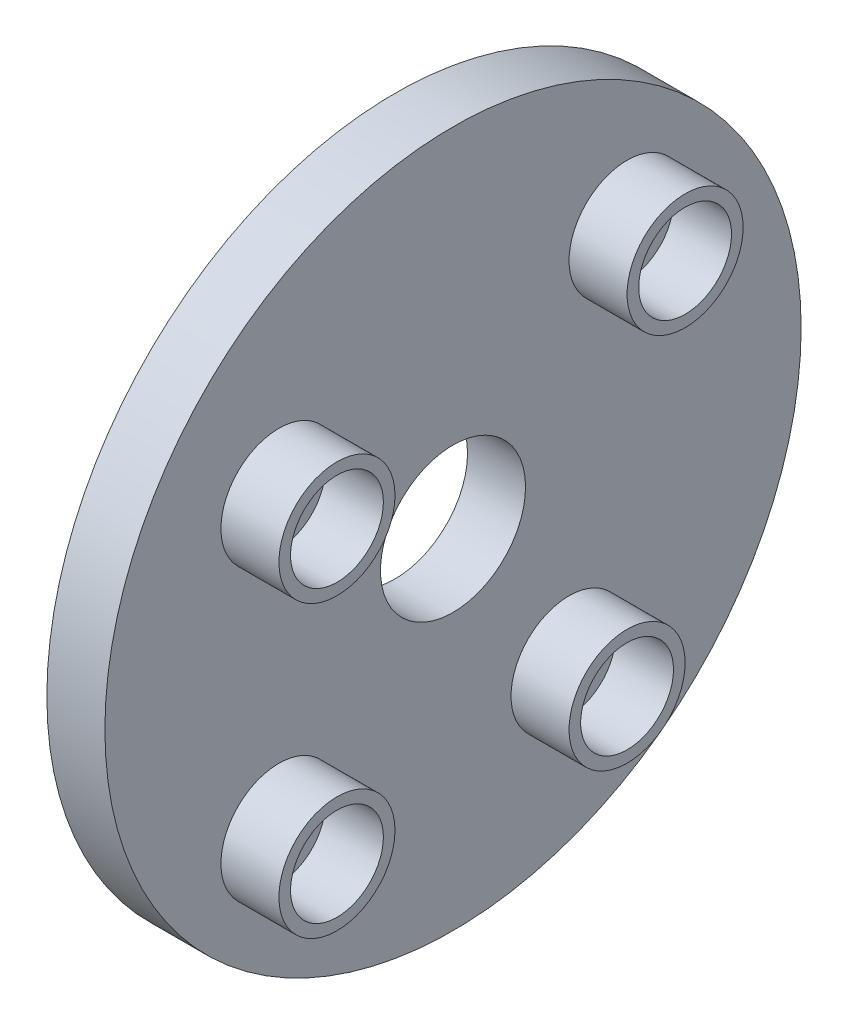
ISO-10303-21;
HEADER;
FILE_DESCRIPTION(('STEP AP214'),'2;1');
FILE_NAME('part.step','',(''),(''),'','','');
FILE_SCHEMA(('AUTOMOTIVE_DESIGN { 1 0 10303 214 1 1 1 1 }'));
ENDSEC;
DATA;
#1=APPLICATION_CONTEXT('core data for automotive mechanical design processes');
#2=APPLICATION_PROTOCOL_DEFINITION('international standard','automotive_design',2000,#1);
#3=PRODUCT_CONTEXT('',#1,'mechanical');
#4=PRODUCT('Part','Part','',(#3));
#5=PRODUCT_RELATED_PRODUCT_CATEGORY('part','',(#4));
#6=PRODUCT_DEFINITION_FORMATION('','',#4);
#7=PRODUCT_DEFINITION_CONTEXT('part definition',#1,'design');
#8=PRODUCT_DEFINITION('design','',#6,#7);
#9=PRODUCT_DEFINITION_SHAPE('','',#8);
#10=(LENGTH_UNIT() NAMED_UNIT(*) SI_UNIT(.MILLI.,.METRE.));
#11=(NAMED_UNIT(*) PLANE_ANGLE_UNIT() SI_UNIT($,.RADIAN.));
#12=(NAMED_UNIT(*) SI_UNIT($,.STERADIAN.) SOLID_ANGLE_UNIT());
#13=UNCERTAINTY_MEASURE_WITH_UNIT(LENGTH_MEASURE(1.E-05),#10,'distance_accuracy_value','');
#14=(GEOMETRIC_REPRESENTATION_CONTEXT(3) GLOBAL_UNCERTAINTY_ASSIGNED_CONTEXT((#13)) GLOBAL_UNIT_ASSIGNED_CONTEXT((#10,
#11,#12)) REPRESENTATION_CONTEXT('',''));
#15=CARTESIAN_POINT('',(0.,0.,0.));
#16=DIRECTION('',(0.,0.,1.));
#17=DIRECTION('',(1.,0.,0.));
#18=AXIS2_PLACEMENT_3D('',#15,#16,#17);
#19=CARTESIAN_POINT('',(0.,0.,0.));
#20=DIRECTION('',(1.,0.,0.));
#21=DIRECTION('',(0.,0.,-1.));
#22=AXIS2_PLACEMENT_3D('',#19,#20,#21);
#23=PLANE('',#22);
#24=CARTESIAN_POINT('',(0.,0.,0.));
#25=DIRECTION('',(1.,0.,0.));
#26=DIRECTION('',(0.,0.,-1.));
#27=AXIS2_PLACEMENT_3D('',#24,#25,#26);
#28=CIRCLE('',#27,12.5);
#29=CARTESIAN_POINT('',(0.,0.,-12.5));
#30=VERTEX_POINT('',#29);
#31=EDGE_CURVE('E68',#30,#30,#28,.T.);
#32=ORIENTED_EDGE('',*,*,#31,.F.);
#33=EDGE_LOOP('',(#32));
#34=FACE_BOUND('',#33,.T.);
#35=CARTESIAN_POINT('',(0.,0.,0.));
#36=DIRECTION('',(1.,0.,0.));
#37=DIRECTION('',(0.,0.,-1.));
#38=AXIS2_PLACEMENT_3D('',#35,#36,#37);
#39=CIRCLE('',#38,60.);
#40=CARTESIAN_POINT('',(0.,0.,-60.));
#41=VERTEX_POINT('',#40);
#42=EDGE_CURVE('E62',#41,#41,#39,.T.);
#43=ORIENTED_EDGE('',*,*,#42,.T.);
#44=EDGE_LOOP('',(#43));
#45=FACE_BOUND('',#44,.T.);
#46=CARTESIAN_POINT('',(0.,20.,30.));
#47=DIRECTION('',(1.,0.,0.));
#48=DIRECTION('',(0.,0.,-1.));
#49=AXIS2_PLACEMENT_3D('',#46,#47,#48);
#50=CIRCLE('',#49,9.99999999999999);
#51=CARTESIAN_POINT('',(0.,20.,20.));
#52=VERTEX_POINT('',#51);
#53=EDGE_CURVE('E56',#52,#52,#50,.T.);
#54=ORIENTED_EDGE('',*,*,#53,.F.);
#55=EDGE_LOOP('',(#54));
#56=FACE_BOUND('',#55,.T.);
#57=CARTESIAN_POINT('',(0.,-30.,30.));
#58=DIRECTION('',(1.,0.,0.));
#59=DIRECTION('',(0.,0.,-1.));
#60=AXIS2_PLACEMENT_3D('',#57,#58,#59);
#61=CIRCLE('',#60,10.);
#62=CARTESIAN_POINT('',(0.,-30.,20.));
#63=VERTEX_POINT('',#62);
#64=EDGE_CURVE('E74',#63,#63,#61,.T.);
#65=ORIENTED_EDGE('',*,*,#64,.F.);
#66=EDGE_LOOP('',(#65));
#67=FACE_BOUND('',#66,.T.);
#68=CARTESIAN_POINT('',(0.,-30.,-20.));
#69=DIRECTION('',(1.,0.,0.));
#70=DIRECTION('',(0.,0.,-1.));
#71=AXIS2_PLACEMENT_3D('',#68,#69,#70);
#72=CIRCLE('',#71,9.99999999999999);
#73=CARTESIAN_POINT('',(0.,-30.,-30.));
#74=VERTEX_POINT('',#73);
#75=EDGE_CURVE('E83',#74,#74,#72,.T.);
#76=ORIENTED_EDGE('',*,*,#75,.F.);
#77=EDGE_LOOP('',(#76));
#78=FACE_BOUND('',#77,.T.);
#79=CARTESIAN_POINT('',(0.,30.,-30.));
#80=DIRECTION('',(1.,0.,0.));
#81=DIRECTION('',(0.,0.,-1.));
#82=AXIS2_PLACEMENT_3D('',#79,#80,#81);
#83=CIRCLE('',#82,9.99999999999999);
#84=CARTESIAN_POINT('',(0.,30.,-40.));
#85=VERTEX_POINT('',#84);
#86=EDGE_CURVE('E92',#85,#85,#83,.T.);
#87=ORIENTED_EDGE('',*,*,#86,.F.);
#88=EDGE_LOOP('',(#87));
#89=FACE_BOUND('',#88,.T.);
#90=ADVANCED_FACE('F30',(#34,#45,#56,#67,#78,#89),#23,.T.);
#91=CARTESIAN_POINT('',(10.,20.,30.));
#92=DIRECTION('',(1.,0.,0.));
#93=DIRECTION('',(0.,0.,-1.));
#94=AXIS2_PLACEMENT_3D('',#91,#92,#93);
#95=PLANE('',#94);
#96=CARTESIAN_POINT('',(10.,20.,30.));
#97=DIRECTION('',(1.,0.,0.));
#98=DIRECTION('',(0.,0.,-1.));
#99=AXIS2_PLACEMENT_3D('',#96,#97,#98);
#100=CIRCLE('',#99,9.99999999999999);
#101=CARTESIAN_POINT('',(10.,20.,20.));
#102=VERTEX_POINT('',#101);
#103=EDGE_CURVE('E45',#102,#102,#100,.T.);
#104=ORIENTED_EDGE('',*,*,#103,.T.);
#105=EDGE_LOOP('',(#104));
#106=FACE_BOUND('',#105,.T.);
#107=CARTESIAN_POINT('',(10.,20.,30.));
#108=DIRECTION('',(1.,0.,0.));
#109=DIRECTION('',(0.,0.,-1.));
#110=AXIS2_PLACEMENT_3D('',#107,#108,#109);
#111=CIRCLE('',#110,7.99999999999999);
#112=CARTESIAN_POINT('',(10.,20.,22.));
#113=VERTEX_POINT('',#112);
#114=EDGE_CURVE('E50',#113,#113,#111,.T.);
#115=ORIENTED_EDGE('',*,*,#114,.F.);
#116=EDGE_LOOP('',(#115));
#117=FACE_BOUND('',#116,.T.);
#118=ADVANCED_FACE('F120',(#106,#117),#95,.T.);
#119=CARTESIAN_POINT('',(10.,20.,30.));
#120=DIRECTION('',(-1.,0.,0.));
#121=DIRECTION('',(0.,0.,1.));
#122=AXIS2_PLACEMENT_3D('',#119,#120,#121);
#123=CYLINDRICAL_SURFACE('',#122,9.99999999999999);
#124=ORIENTED_EDGE('',*,*,#103,.F.);
#125=EDGE_LOOP('',(#124));
#126=FACE_BOUND('',#125,.T.);
#127=ORIENTED_EDGE('',*,*,#53,.T.);
#128=EDGE_LOOP('',(#127));
#129=FACE_BOUND('',#128,.T.);
#130=ADVANCED_FACE('F32',(#126,#129),#123,.T.);
#131=CARTESIAN_POINT('',(10.,20.,30.));
#132=DIRECTION('',(-1.,0.,0.));
#133=DIRECTION('',(0.,0.,1.));
#134=AXIS2_PLACEMENT_3D('',#131,#132,#133);
#135=CYLINDRICAL_SURFACE('',#134,7.99999999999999);
#136=ORIENTED_EDGE('',*,*,#114,.T.);
#137=EDGE_LOOP('',(#136));
#138=FACE_BOUND('',#137,.T.);
#139=CARTESIAN_POINT('',(0.,20.,30.));
#140=DIRECTION('',(1.,0.,0.));
#141=DIRECTION('',(0.,0.,-1.));
#142=AXIS2_PLACEMENT_3D('',#139,#140,#141);
#143=CIRCLE('',#142,7.99999999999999);
#144=CARTESIAN_POINT('',(0.,20.,22.));
#145=VERTEX_POINT('',#144);
#146=EDGE_CURVE('E53',#145,#145,#143,.T.);
#147=ORIENTED_EDGE('',*,*,#146,.F.);
#148=EDGE_LOOP('',(#147));
#149=FACE_BOUND('',#148,.T.);
#150=ADVANCED_FACE('F135',(#138,#149),#135,.F.);
#151=ORIENTED_EDGE('',*,*,#146,.T.);
#152=EDGE_LOOP('',(#151));
#153=FACE_BOUND('',#152,.T.);
#154=ADVANCED_FACE('F122',(#153),#23,.T.);
#155=CARTESIAN_POINT('',(-10.,0.,0.));
#156=DIRECTION('',(1.,0.,0.));
#157=DIRECTION('',(0.,0.,-1.));
#158=AXIS2_PLACEMENT_3D('',#155,#156,#157);
#159=CYLINDRICAL_SURFACE('',#158,60.);
#160=CARTESIAN_POINT('',(-10.,0.,0.));
#161=DIRECTION('',(1.,0.,0.));
#162=DIRECTION('',(0.,0.,-1.));
#163=AXIS2_PLACEMENT_3D('',#160,#161,#162);
#164=CIRCLE('',#163,60.);
#165=CARTESIAN_POINT('',(-10.,0.,-60.));
#166=VERTEX_POINT('',#165);
#167=EDGE_CURVE('E59',#166,#166,#164,.T.);
#168=ORIENTED_EDGE('',*,*,#167,.T.);
#169=EDGE_LOOP('',(#168));
#170=FACE_BOUND('',#169,.T.);
#171=ORIENTED_EDGE('',*,*,#42,.F.);
#172=EDGE_LOOP('',(#171));
#173=FACE_BOUND('',#172,.T.);
#174=ADVANCED_FACE('F134',(#170,#173),#159,.T.);
#175=CARTESIAN_POINT('',(-10.,0.,0.));
#176=DIRECTION('',(1.,0.,0.));
#177=DIRECTION('',(0.,0.,-1.));
#178=AXIS2_PLACEMENT_3D('',#175,#176,#177);
#179=PLANE('',#178);
#180=CARTESIAN_POINT('',(-10.,0.,0.));
#181=DIRECTION('',(1.,0.,0.));
#182=DIRECTION('',(0.,0.,-1.));
#183=AXIS2_PLACEMENT_3D('',#180,#181,#182);
#184=CIRCLE('',#183,12.5);
#185=CARTESIAN_POINT('',(-10.,0.,-12.5));
#186=VERTEX_POINT('',#185);
#187=EDGE_CURVE('E65',#186,#186,#184,.T.);
#188=ORIENTED_EDGE('',*,*,#187,.T.);
#189=EDGE_LOOP('',(#188));
#190=FACE_BOUND('',#189,.T.);
#191=ORIENTED_EDGE('',*,*,#167,.F.);
#192=EDGE_LOOP('',(#191));
#193=FACE_BOUND('',#192,.T.);
#194=ADVANCED_FACE('F141',(#190,#193),#179,.F.);
#195=CARTESIAN_POINT('',(-10.,0.,0.));
#196=DIRECTION('',(1.,0.,0.));
#197=DIRECTION('',(0.,0.,-1.));
#198=AXIS2_PLACEMENT_3D('',#195,#196,#197);
#199=CYLINDRICAL_SURFACE('',#198,12.5);
#200=ORIENTED_EDGE('',*,*,#187,.F.);
#201=EDGE_LOOP('',(#200));
#202=FACE_BOUND('',#201,.T.);
#203=ORIENTED_EDGE('',*,*,#31,.T.);
#204=EDGE_LOOP('',(#203));
#205=FACE_BOUND('',#204,.T.);
#206=ADVANCED_FACE('F171',(#202,#205),#199,.F.);
#207=CARTESIAN_POINT('',(10.,-30.,30.));
#208=DIRECTION('',(1.,0.,0.));
#209=DIRECTION('',(0.,0.,-1.));
#210=AXIS2_PLACEMENT_3D('',#207,#208,#209);
#211=PLANE('',#210);
#212=CARTESIAN_POINT('',(10.,-30.,30.));
#213=DIRECTION('',(1.,0.,0.));
#214=DIRECTION('',(0.,0.,-1.));
#215=AXIS2_PLACEMENT_3D('',#212,#213,#214);
#216=CIRCLE('',#215,10.);
#217=CARTESIAN_POINT('',(10.,-30.,20.));
#218=VERTEX_POINT('',#217);
#219=EDGE_CURVE('E71',#218,#218,#216,.T.);
#220=ORIENTED_EDGE('',*,*,#219,.T.);
#221=EDGE_LOOP('',(#220));
#222=FACE_BOUND('',#221,.T.);
#223=CARTESIAN_POINT('',(10.,-30.,30.));
#224=DIRECTION('',(1.,0.,0.));
#225=DIRECTION('',(0.,0.,-1.));
#226=AXIS2_PLACEMENT_3D('',#223,#224,#225);
#227=CIRCLE('',#226,8.00000000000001);
#228=CARTESIAN_POINT('',(10.,-30.,22.));
#229=VERTEX_POINT('',#228);
#230=EDGE_CURVE('E77',#229,#229,#227,.T.);
#231=ORIENTED_EDGE('',*,*,#230,.F.);
#232=EDGE_LOOP('',(#231));
#233=FACE_BOUND('',#232,.T.);
#234=ADVANCED_FACE('F165',(#222,#233),#211,.T.);
#235=CARTESIAN_POINT('',(10.,-30.,30.));
#236=DIRECTION('',(-1.,0.,0.));
#237=DIRECTION('',(0.,0.,1.));
#238=AXIS2_PLACEMENT_3D('',#235,#236,#237);
#239=CYLINDRICAL_SURFACE('',#238,10.);
#240=ORIENTED_EDGE('',*,*,#219,.F.);
#241=EDGE_LOOP('',(#240));
#242=FACE_BOUND('',#241,.T.);
#243=ORIENTED_EDGE('',*,*,#64,.T.);
#244=EDGE_LOOP('',(#243));
#245=FACE_BOUND('',#244,.T.);
#246=ADVANCED_FACE('F157',(#242,#245),#239,.T.);
#247=CARTESIAN_POINT('',(10.,-30.,30.));
#248=DIRECTION('',(-1.,0.,0.));
#249=DIRECTION('',(0.,0.,1.));
#250=AXIS2_PLACEMENT_3D('',#247,#248,#249);
#251=CYLINDRICAL_SURFACE('',#250,8.00000000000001);
#252=ORIENTED_EDGE('',*,*,#230,.T.);
#253=EDGE_LOOP('',(#252));
#254=FACE_BOUND('',#253,.T.);
#255=CARTESIAN_POINT('',(0.,-30.,30.));
#256=DIRECTION('',(1.,0.,0.));
#257=DIRECTION('',(0.,0.,-1.));
#258=AXIS2_PLACEMENT_3D('',#255,#256,#257);
#259=CIRCLE('',#258,8.00000000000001);
#260=CARTESIAN_POINT('',(0.,-30.,22.));
#261=VERTEX_POINT('',#260);
#262=EDGE_CURVE('E41',#261,#261,#259,.F.);
#263=ORIENTED_EDGE('',*,*,#262,.T.);
#264=EDGE_LOOP('',(#263));
#265=FACE_BOUND('',#264,.T.);
#266=ADVANCED_FACE('F148',(#254,#265),#251,.F.);
#267=ORIENTED_EDGE('',*,*,#262,.F.);
#268=EDGE_LOOP('',(#267));
#269=FACE_BOUND('',#268,.T.);
#270=ADVANCED_FACE('F116',(#269),#23,.T.);
#271=CARTESIAN_POINT('',(10.,-30.,-20.));
#272=DIRECTION('',(1.,0.,0.));
#273=DIRECTION('',(0.,0.,-1.));
#274=AXIS2_PLACEMENT_3D('',#271,#272,#273);
#275=PLANE('',#274);
#276=CARTESIAN_POINT('',(10.,-30.,-20.));
#277=DIRECTION('',(1.,0.,0.));
#278=DIRECTION('',(0.,0.,-1.));
#279=AXIS2_PLACEMENT_3D('',#276,#277,#278);
#280=CIRCLE('',#279,9.99999999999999);
#281=CARTESIAN_POINT('',(10.,-30.,-30.));
#282=VERTEX_POINT('',#281);
#283=EDGE_CURVE('E80',#282,#282,#280,.T.);
#284=ORIENTED_EDGE('',*,*,#283,.T.);
#285=EDGE_LOOP('',(#284));
#286=FACE_BOUND('',#285,.T.);
#287=CARTESIAN_POINT('',(10.,-30.,-20.));
#288=DIRECTION('',(1.,0.,0.));
#289=DIRECTION('',(0.,0.,-1.));
#290=AXIS2_PLACEMENT_3D('',#287,#288,#289);
#291=CIRCLE('',#290,7.99999999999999);
#292=CARTESIAN_POINT('',(10.,-30.,-28.));
#293=VERTEX_POINT('',#292);
#294=EDGE_CURVE('E86',#293,#293,#291,.T.);
#295=ORIENTED_EDGE('',*,*,#294,.F.);
#296=EDGE_LOOP('',(#295));
#297=FACE_BOUND('',#296,.T.);
#298=ADVANCED_FACE('F147',(#286,#297),#275,.T.);
#299=CARTESIAN_POINT('',(10.,-30.,-20.));
#300=DIRECTION('',(-1.,0.,0.));
#301=DIRECTION('',(0.,0.,1.));
#302=AXIS2_PLACEMENT_3D('',#299,#300,#301);
#303=CYLINDRICAL_SURFACE('',#302,9.99999999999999);
#304=ORIENTED_EDGE('',*,*,#283,.F.);
#305=EDGE_LOOP('',(#304));
#306=FACE_BOUND('',#305,.T.);
#307=ORIENTED_EDGE('',*,*,#75,.T.);
#308=EDGE_LOOP('',(#307));
#309=FACE_BOUND('',#308,.T.);
#310=ADVANCED_FACE('F154',(#306,#309),#303,.T.);
#311=CARTESIAN_POINT('',(10.,-30.,-20.));
#312=DIRECTION('',(-1.,0.,0.));
#313=DIRECTION('',(0.,0.,1.));
#314=AXIS2_PLACEMENT_3D('',#311,#312,#313);
#315=CYLINDRICAL_SURFACE('',#314,7.99999999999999);
#316=ORIENTED_EDGE('',*,*,#294,.T.);
#317=EDGE_LOOP('',(#316));
#318=FACE_BOUND('',#317,.T.);
#319=CARTESIAN_POINT('',(0.,-30.,-20.));
#320=DIRECTION('',(1.,0.,0.));
#321=DIRECTION('',(0.,0.,-1.));
#322=AXIS2_PLACEMENT_3D('',#319,#320,#321);
#323=CIRCLE('',#322,7.99999999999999);
#324=CARTESIAN_POINT('',(0.,-30.,-28.));
#325=VERTEX_POINT('',#324);
#326=EDGE_CURVE('E37',#325,#325,#323,.F.);
#327=ORIENTED_EDGE('',*,*,#326,.T.);
#328=EDGE_LOOP('',(#327));
#329=FACE_BOUND('',#328,.T.);
#330=ADVANCED_FACE('F113',(#318,#329),#315,.F.);
#331=ORIENTED_EDGE('',*,*,#326,.F.);
#332=EDGE_LOOP('',(#331));
#333=FACE_BOUND('',#332,.T.);
#334=ADVANCED_FACE('F104',(#333),#23,.T.);
#335=CARTESIAN_POINT('',(10.,30.,-30.));
#336=DIRECTION('',(1.,0.,0.));
#337=DIRECTION('',(0.,0.,-1.));
#338=AXIS2_PLACEMENT_3D('',#335,#336,#337);
#339=PLANE('',#338);
#340=CARTESIAN_POINT('',(10.,30.,-30.));
#341=DIRECTION('',(1.,0.,0.));
#342=DIRECTION('',(0.,0.,-1.));
#343=AXIS2_PLACEMENT_3D('',#340,#341,#342);
#344=CIRCLE('',#343,9.99999999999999);
#345=CARTESIAN_POINT('',(10.,30.,-40.));
#346=VERTEX_POINT('',#345);
#347=EDGE_CURVE('E89',#346,#346,#344,.T.);
#348=ORIENTED_EDGE('',*,*,#347,.T.);
#349=EDGE_LOOP('',(#348));
#350=FACE_BOUND('',#349,.T.);
#351=CARTESIAN_POINT('',(10.,30.,-30.));
#352=DIRECTION('',(1.,0.,0.));
#353=DIRECTION('',(0.,0.,-1.));
#354=AXIS2_PLACEMENT_3D('',#351,#352,#353);
#355=CIRCLE('',#354,7.99999999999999);
#356=CARTESIAN_POINT('',(10.,30.,-38.));
#357=VERTEX_POINT('',#356);
#358=EDGE_CURVE('E95',#357,#357,#355,.T.);
#359=ORIENTED_EDGE('',*,*,#358,.F.);
#360=EDGE_LOOP('',(#359));
#361=FACE_BOUND('',#360,.T.);
#362=ADVANCED_FACE('F101',(#350,#361),#339,.T.);
#363=CARTESIAN_POINT('',(10.,30.,-30.));
#364=DIRECTION('',(-1.,0.,0.));
#365=DIRECTION('',(0.,0.,1.));
#366=AXIS2_PLACEMENT_3D('',#363,#364,#365);
#367=CYLINDRICAL_SURFACE('',#366,9.99999999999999);
#368=ORIENTED_EDGE('',*,*,#347,.F.);
#369=EDGE_LOOP('',(#368));
#370=FACE_BOUND('',#369,.T.);
#371=ORIENTED_EDGE('',*,*,#86,.T.);
#372=EDGE_LOOP('',(#371));
#373=FACE_BOUND('',#372,.T.);
#374=ADVANCED_FACE('F103',(#370,#373),#367,.T.);
#375=CARTESIAN_POINT('',(10.,30.,-30.));
#376=DIRECTION('',(-1.,0.,0.));
#377=DIRECTION('',(0.,0.,1.));
#378=AXIS2_PLACEMENT_3D('',#375,#376,#377);
#379=CYLINDRICAL_SURFACE('',#378,7.99999999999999);
#380=ORIENTED_EDGE('',*,*,#358,.T.);
#381=EDGE_LOOP('',(#380));
#382=FACE_BOUND('',#381,.T.);
#383=CARTESIAN_POINT('',(0.,30.,-30.));
#384=DIRECTION('',(1.,0.,0.));
#385=DIRECTION('',(0.,0.,-1.));
#386=AXIS2_PLACEMENT_3D('',#383,#384,#385);
#387=CIRCLE('',#386,7.99999999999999);
#388=CARTESIAN_POINT('',(0.,30.,-38.));
#389=VERTEX_POINT('',#388);
#390=EDGE_CURVE('E10',#389,#389,#387,.F.);
#391=ORIENTED_EDGE('',*,*,#390,.T.);
#392=EDGE_LOOP('',(#391));
#393=FACE_BOUND('',#392,.T.);
#394=ADVANCED_FACE('F99',(#382,#393),#379,.F.);
#395=ORIENTED_EDGE('',*,*,#390,.F.);
#396=EDGE_LOOP('',(#395));
#397=FACE_BOUND('',#396,.T.);
#398=ADVANCED_FACE('F117',(#397),#23,.T.);
#399=CLOSED_SHELL('',(#90,#118,#130,#150,#154,#174,#194,#206,#234,#246,#266,#270,#298,#310,#330,
#334,#362,#374,#394,#398));
#400=MANIFOLD_SOLID_BREP('B2',#399);
#401=ADVANCED_BREP_SHAPE_REPRESENTATION('',(#18,#400),#14);
#402=SHAPE_DEFINITION_REPRESENTATION(#9,#401);
ENDSEC;
END-ISO-10303-21;
